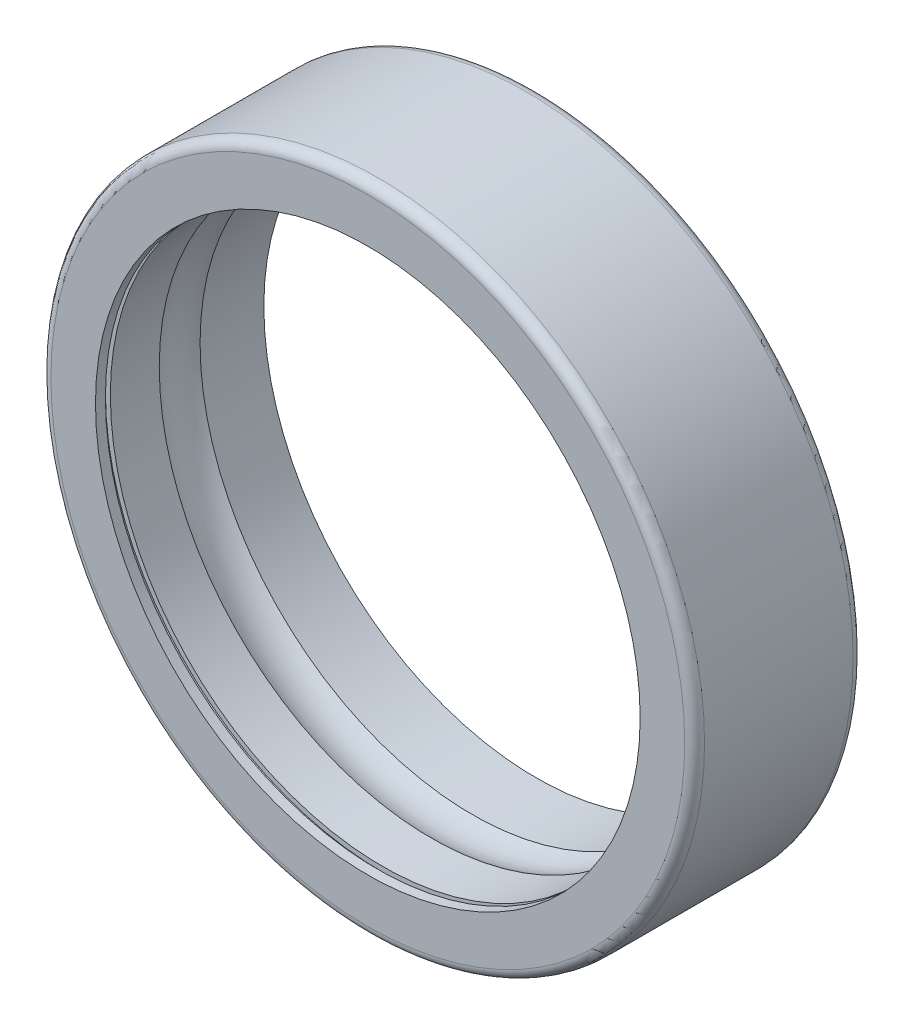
ISO-10303-21;
HEADER;
FILE_DESCRIPTION(('STEP AP214'),'2;1');
FILE_NAME('part.step','',(''),(''),'','','');
FILE_SCHEMA(('AUTOMOTIVE_DESIGN { 1 0 10303 214 1 1 1 1 }'));
ENDSEC;
DATA;
#1=APPLICATION_CONTEXT('core data for automotive mechanical design processes');
#2=APPLICATION_PROTOCOL_DEFINITION('international standard','automotive_design',2000,#1);
#3=PRODUCT_CONTEXT('',#1,'mechanical');
#4=PRODUCT('Part','Part','',(#3));
#5=PRODUCT_RELATED_PRODUCT_CATEGORY('part','',(#4));
#6=PRODUCT_DEFINITION_FORMATION('','',#4);
#7=PRODUCT_DEFINITION_CONTEXT('part definition',#1,'design');
#8=PRODUCT_DEFINITION('design','',#6,#7);
#9=PRODUCT_DEFINITION_SHAPE('','',#8);
#10=(LENGTH_UNIT() NAMED_UNIT(*) SI_UNIT(.MILLI.,.METRE.));
#11=(NAMED_UNIT(*) PLANE_ANGLE_UNIT() SI_UNIT($,.RADIAN.));
#12=(NAMED_UNIT(*) SI_UNIT($,.STERADIAN.) SOLID_ANGLE_UNIT());
#13=UNCERTAINTY_MEASURE_WITH_UNIT(LENGTH_MEASURE(1.E-05),#10,'distance_accuracy_value','');
#14=(GEOMETRIC_REPRESENTATION_CONTEXT(3) GLOBAL_UNCERTAINTY_ASSIGNED_CONTEXT((#13)) GLOBAL_UNIT_ASSIGNED_CONTEXT((#10,
#11,#12)) REPRESENTATION_CONTEXT('',''));
#15=CARTESIAN_POINT('',(0.,0.,0.));
#16=DIRECTION('',(0.,0.,1.));
#17=DIRECTION('',(1.,0.,0.));
#18=AXIS2_PLACEMENT_3D('',#15,#16,#17);
#19=CARTESIAN_POINT('',(0.,14.,3.5));
#20=DIRECTION('',(0.,0.,1.));
#21=DIRECTION('',(1.,0.,0.));
#22=AXIS2_PLACEMENT_3D('',#19,#20,#21);
#23=PLANE('',#22);
#24=CARTESIAN_POINT('',(0.,0.,3.5));
#25=DIRECTION('',(0.,0.,-1.));
#26=DIRECTION('',(-1.,0.,0.));
#27=AXIS2_PLACEMENT_3D('',#24,#25,#26);
#28=CIRCLE('',#27,13.75);
#29=CARTESIAN_POINT('',(-13.75,0.,3.5));
#30=VERTEX_POINT('',#29);
#31=EDGE_CURVE('E10',#30,#30,#28,.T.);
#32=ORIENTED_EDGE('',*,*,#31,.T.);
#33=EDGE_LOOP('',(#32));
#34=FACE_BOUND('',#33,.T.);
#35=CARTESIAN_POINT('',(0.,0.,3.5));
#36=DIRECTION('',(0.,0.,-1.));
#37=DIRECTION('',(-1.,0.,0.));
#38=AXIS2_PLACEMENT_3D('',#35,#36,#37);
#39=CIRCLE('',#38,14.);
#40=CARTESIAN_POINT('',(-14.,0.,3.5));
#41=VERTEX_POINT('',#40);
#42=EDGE_CURVE('E70',#41,#41,#39,.T.);
#43=ORIENTED_EDGE('',*,*,#42,.F.);
#44=EDGE_LOOP('',(#43));
#45=FACE_BOUND('',#44,.T.);
#46=ADVANCED_FACE('F30',(#34,#45),#23,.T.);
#47=CARTESIAN_POINT('',(0.,0.,0.));
#48=DIRECTION('',(0.,0.,-1.));
#49=DIRECTION('',(-1.,0.,0.));
#50=AXIS2_PLACEMENT_3D('',#47,#48,#49);
#51=CYLINDRICAL_SURFACE('',#50,13.75);
#52=ORIENTED_EDGE('',*,*,#31,.F.);
#53=EDGE_LOOP('',(#52));
#54=FACE_BOUND('',#53,.T.);
#55=CARTESIAN_POINT('',(0.,0.,1.03077640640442));
#56=DIRECTION('',(0.,0.,-1.));
#57=DIRECTION('',(-1.,0.,0.));
#58=AXIS2_PLACEMENT_3D('',#55,#56,#57);
#59=CIRCLE('',#58,13.75);
#60=CARTESIAN_POINT('',(-13.75,0.,1.03077640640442));
#61=VERTEX_POINT('',#60);
#62=EDGE_CURVE('E36',#61,#61,#59,.T.);
#63=ORIENTED_EDGE('',*,*,#62,.T.);
#64=EDGE_LOOP('',(#63));
#65=FACE_BOUND('',#64,.T.);
#66=ADVANCED_FACE('F78',(#54,#65),#51,.F.);
#67=CARTESIAN_POINT('',(0.,0.,0.));
#68=DIRECTION('',(0.,0.,-1.));
#69=DIRECTION('',(-1.,0.,0.));
#70=AXIS2_PLACEMENT_3D('',#67,#68,#69);
#71=TOROIDAL_SURFACE('',#70,11.75,2.25);
#72=ORIENTED_EDGE('',*,*,#62,.F.);
#73=EDGE_LOOP('',(#72));
#74=FACE_BOUND('',#73,.T.);
#75=CARTESIAN_POINT('',(0.,0.,-1.03077640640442));
#76=DIRECTION('',(0.,0.,-1.));
#77=DIRECTION('',(-1.,0.,0.));
#78=AXIS2_PLACEMENT_3D('',#75,#76,#77);
#79=CIRCLE('',#78,13.75);
#80=CARTESIAN_POINT('',(-13.75,0.,-1.03077640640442));
#81=VERTEX_POINT('',#80);
#82=EDGE_CURVE('E40',#81,#81,#79,.T.);
#83=ORIENTED_EDGE('',*,*,#82,.T.);
#84=EDGE_LOOP('',(#83));
#85=FACE_BOUND('',#84,.T.);
#86=ADVANCED_FACE('F82',(#74,#85),#71,.F.);
#87=CARTESIAN_POINT('',(0.,0.,0.));
#88=DIRECTION('',(0.,0.,-1.));
#89=DIRECTION('',(-1.,0.,0.));
#90=AXIS2_PLACEMENT_3D('',#87,#88,#89);
#91=CYLINDRICAL_SURFACE('',#90,13.75);
#92=ORIENTED_EDGE('',*,*,#82,.F.);
#93=EDGE_LOOP('',(#92));
#94=FACE_BOUND('',#93,.T.);
#95=CARTESIAN_POINT('',(0.,0.,-4.25));
#96=DIRECTION('',(0.,0.,-1.));
#97=DIRECTION('',(-1.,0.,0.));
#98=AXIS2_PLACEMENT_3D('',#95,#96,#97);
#99=CIRCLE('',#98,13.75);
#100=CARTESIAN_POINT('',(-13.75,0.,-4.25));
#101=VERTEX_POINT('',#100);
#102=EDGE_CURVE('E44',#101,#101,#99,.T.);
#103=ORIENTED_EDGE('',*,*,#102,.T.);
#104=EDGE_LOOP('',(#103));
#105=FACE_BOUND('',#104,.T.);
#106=ADVANCED_FACE('F87',(#94,#105),#91,.F.);
#107=CARTESIAN_POINT('',(0.,13.75,-4.25));
#108=DIRECTION('',(0.,0.,-1.));
#109=DIRECTION('',(-1.,0.,0.));
#110=AXIS2_PLACEMENT_3D('',#107,#108,#109);
#111=PLANE('',#110);
#112=CARTESIAN_POINT('',(0.,0.,-4.25000000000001));
#113=DIRECTION('',(0.,0.,-1.));
#114=DIRECTION('',(-1.,0.,0.));
#115=AXIS2_PLACEMENT_3D('',#112,#113,#114);
#116=CIRCLE('',#115,16.);
#117=CARTESIAN_POINT('',(-16.,0.,-4.25000000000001));
#118=VERTEX_POINT('',#117);
#119=EDGE_CURVE('E49',#118,#118,#116,.T.);
#120=ORIENTED_EDGE('',*,*,#119,.T.);
#121=EDGE_LOOP('',(#120));
#122=FACE_BOUND('',#121,.T.);
#123=ORIENTED_EDGE('',*,*,#102,.F.);
#124=EDGE_LOOP('',(#123));
#125=FACE_BOUND('',#124,.T.);
#126=ADVANCED_FACE('F93',(#122,#125),#111,.T.);
#127=CARTESIAN_POINT('',(0.,0.,-3.75));
#128=DIRECTION('',(0.,0.,-1.));
#129=DIRECTION('',(-1.,0.,0.));
#130=AXIS2_PLACEMENT_3D('',#127,#128,#129);
#131=TOROIDAL_SURFACE('',#130,16.,0.500000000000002);
#132=CARTESIAN_POINT('',(0.,0.,-3.75));
#133=DIRECTION('',(0.,0.,-1.));
#134=DIRECTION('',(-1.,0.,0.));
#135=AXIS2_PLACEMENT_3D('',#132,#133,#134);
#136=CIRCLE('',#135,16.5);
#137=CARTESIAN_POINT('',(-16.5,0.,-3.75));
#138=VERTEX_POINT('',#137);
#139=EDGE_CURVE('E52',#138,#138,#136,.T.);
#140=ORIENTED_EDGE('',*,*,#139,.T.);
#141=EDGE_LOOP('',(#140));
#142=FACE_BOUND('',#141,.T.);
#143=ORIENTED_EDGE('',*,*,#119,.F.);
#144=EDGE_LOOP('',(#143));
#145=FACE_BOUND('',#144,.T.);
#146=ADVANCED_FACE('F97',(#142,#145),#131,.T.);
#147=CARTESIAN_POINT('',(0.,0.,0.));
#148=DIRECTION('',(0.,0.,-1.));
#149=DIRECTION('',(-1.,0.,0.));
#150=AXIS2_PLACEMENT_3D('',#147,#148,#149);
#151=CYLINDRICAL_SURFACE('',#150,16.5);
#152=ORIENTED_EDGE('',*,*,#139,.F.);
#153=EDGE_LOOP('',(#152));
#154=FACE_BOUND('',#153,.T.);
#155=CARTESIAN_POINT('',(0.,0.,3.75));
#156=DIRECTION('',(0.,0.,-1.));
#157=DIRECTION('',(-1.,0.,0.));
#158=AXIS2_PLACEMENT_3D('',#155,#156,#157);
#159=CIRCLE('',#158,16.5);
#160=CARTESIAN_POINT('',(-16.5,0.,3.75));
#161=VERTEX_POINT('',#160);
#162=EDGE_CURVE('E55',#161,#161,#159,.T.);
#163=ORIENTED_EDGE('',*,*,#162,.T.);
#164=EDGE_LOOP('',(#163));
#165=FACE_BOUND('',#164,.T.);
#166=ADVANCED_FACE('F101',(#154,#165),#151,.T.);
#167=CARTESIAN_POINT('',(0.,0.,3.75));
#168=DIRECTION('',(0.,0.,-1.));
#169=DIRECTION('',(-1.,0.,0.));
#170=AXIS2_PLACEMENT_3D('',#167,#168,#169);
#171=TOROIDAL_SURFACE('',#170,16.,0.500000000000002);
#172=ORIENTED_EDGE('',*,*,#162,.F.);
#173=EDGE_LOOP('',(#172));
#174=FACE_BOUND('',#173,.T.);
#175=CARTESIAN_POINT('',(0.,0.,4.25));
#176=DIRECTION('',(0.,0.,-1.));
#177=DIRECTION('',(-1.,0.,0.));
#178=AXIS2_PLACEMENT_3D('',#175,#176,#177);
#179=CIRCLE('',#178,16.);
#180=CARTESIAN_POINT('',(-16.,0.,4.25));
#181=VERTEX_POINT('',#180);
#182=EDGE_CURVE('E58',#181,#181,#179,.T.);
#183=ORIENTED_EDGE('',*,*,#182,.T.);
#184=EDGE_LOOP('',(#183));
#185=FACE_BOUND('',#184,.T.);
#186=ADVANCED_FACE('F105',(#174,#185),#171,.T.);
#187=CARTESIAN_POINT('',(0.,16.,4.25));
#188=DIRECTION('',(0.,0.,1.));
#189=DIRECTION('',(1.,0.,0.));
#190=AXIS2_PLACEMENT_3D('',#187,#188,#189);
#191=PLANE('',#190);
#192=CARTESIAN_POINT('',(0.,0.,4.25));
#193=DIRECTION('',(0.,0.,-1.));
#194=DIRECTION('',(-1.,0.,0.));
#195=AXIS2_PLACEMENT_3D('',#192,#193,#194);
#196=CIRCLE('',#195,13.75);
#197=CARTESIAN_POINT('',(-13.75,0.,4.25));
#198=VERTEX_POINT('',#197);
#199=EDGE_CURVE('E61',#198,#198,#196,.T.);
#200=ORIENTED_EDGE('',*,*,#199,.T.);
#201=EDGE_LOOP('',(#200));
#202=FACE_BOUND('',#201,.T.);
#203=ORIENTED_EDGE('',*,*,#182,.F.);
#204=EDGE_LOOP('',(#203));
#205=FACE_BOUND('',#204,.T.);
#206=ADVANCED_FACE('F109',(#202,#205),#191,.T.);
#207=CARTESIAN_POINT('',(0.,0.,0.));
#208=DIRECTION('',(0.,0.,-1.));
#209=DIRECTION('',(-1.,0.,0.));
#210=AXIS2_PLACEMENT_3D('',#207,#208,#209);
#211=CYLINDRICAL_SURFACE('',#210,13.75);
#212=ORIENTED_EDGE('',*,*,#199,.F.);
#213=EDGE_LOOP('',(#212));
#214=FACE_BOUND('',#213,.T.);
#215=CARTESIAN_POINT('',(0.,0.,3.75));
#216=DIRECTION('',(0.,0.,-1.));
#217=DIRECTION('',(-1.,0.,0.));
#218=AXIS2_PLACEMENT_3D('',#215,#216,#217);
#219=CIRCLE('',#218,13.75);
#220=CARTESIAN_POINT('',(-13.75,0.,3.75));
#221=VERTEX_POINT('',#220);
#222=EDGE_CURVE('E64',#221,#221,#219,.T.);
#223=ORIENTED_EDGE('',*,*,#222,.T.);
#224=EDGE_LOOP('',(#223));
#225=FACE_BOUND('',#224,.T.);
#226=ADVANCED_FACE('F113',(#214,#225),#211,.F.);
#227=CARTESIAN_POINT('',(0.,13.75,3.75));
#228=DIRECTION('',(0.,0.,-1.));
#229=DIRECTION('',(-1.,0.,0.));
#230=AXIS2_PLACEMENT_3D('',#227,#228,#229);
#231=PLANE('',#230);
#232=CARTESIAN_POINT('',(0.,0.,3.75));
#233=DIRECTION('',(0.,0.,-1.));
#234=DIRECTION('',(-1.,0.,0.));
#235=AXIS2_PLACEMENT_3D('',#232,#233,#234);
#236=CIRCLE('',#235,14.);
#237=CARTESIAN_POINT('',(-14.,0.,3.75));
#238=VERTEX_POINT('',#237);
#239=EDGE_CURVE('E67',#238,#238,#236,.T.);
#240=ORIENTED_EDGE('',*,*,#239,.T.);
#241=EDGE_LOOP('',(#240));
#242=FACE_BOUND('',#241,.T.);
#243=ORIENTED_EDGE('',*,*,#222,.F.);
#244=EDGE_LOOP('',(#243));
#245=FACE_BOUND('',#244,.T.);
#246=ADVANCED_FACE('F117',(#242,#245),#231,.T.);
#247=CARTESIAN_POINT('',(0.,0.,0.));
#248=DIRECTION('',(0.,0.,-1.));
#249=DIRECTION('',(-1.,0.,0.));
#250=AXIS2_PLACEMENT_3D('',#247,#248,#249);
#251=CYLINDRICAL_SURFACE('',#250,14.);
#252=ORIENTED_EDGE('',*,*,#42,.T.);
#253=EDGE_LOOP('',(#252));
#254=FACE_BOUND('',#253,.T.);
#255=ORIENTED_EDGE('',*,*,#239,.F.);
#256=EDGE_LOOP('',(#255));
#257=FACE_BOUND('',#256,.T.);
#258=ADVANCED_FACE('F74',(#254,#257),#251,.F.);
#259=CLOSED_SHELL('',(#46,#66,#86,#106,#126,#146,#166,#186,#206,#226,#246,#258));
#260=MANIFOLD_SOLID_BREP('B2',#259);
#261=ADVANCED_BREP_SHAPE_REPRESENTATION('',(#18,#260),#14);
#262=SHAPE_DEFINITION_REPRESENTATION(#9,#261);
ENDSEC;
END-ISO-10303-21;
